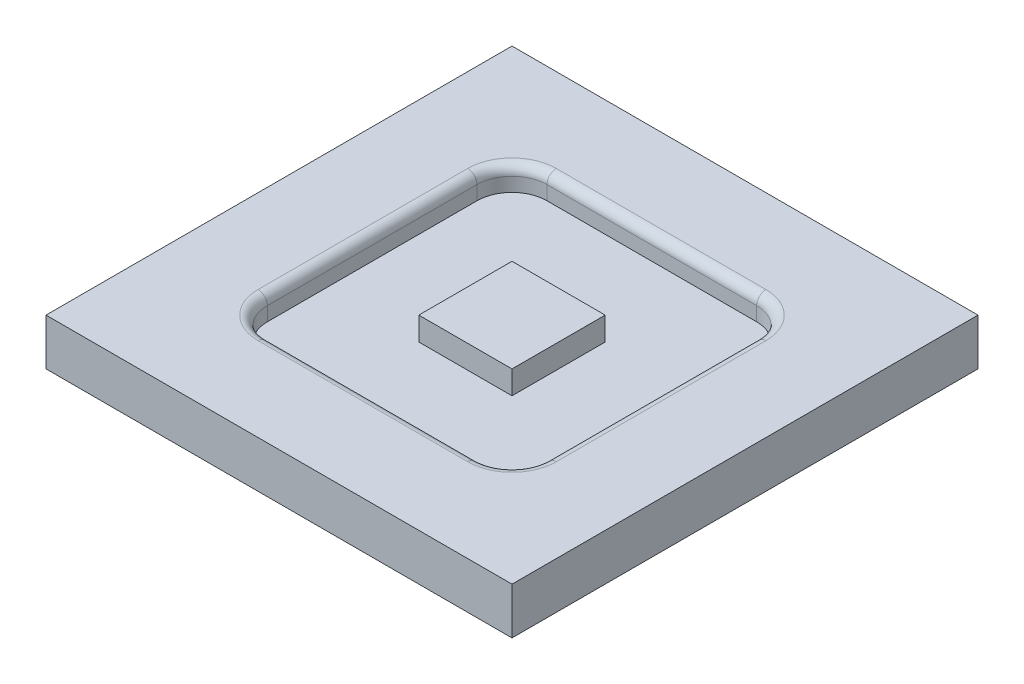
ISO-10303-21;
HEADER;
FILE_DESCRIPTION(('STEP AP214'),'2;1');
FILE_NAME('part.step','',(''),(''),'','','');
FILE_SCHEMA(('AUTOMOTIVE_DESIGN { 1 0 10303 214 1 1 1 1 }'));
ENDSEC;
DATA;
#1=APPLICATION_CONTEXT('core data for automotive mechanical design processes');
#2=APPLICATION_PROTOCOL_DEFINITION('international standard','automotive_design',2000,#1);
#3=PRODUCT_CONTEXT('',#1,'mechanical');
#4=PRODUCT('Part','Part','',(#3));
#5=PRODUCT_RELATED_PRODUCT_CATEGORY('part','',(#4));
#6=PRODUCT_DEFINITION_FORMATION('','',#4);
#7=PRODUCT_DEFINITION_CONTEXT('part definition',#1,'design');
#8=PRODUCT_DEFINITION('design','',#6,#7);
#9=PRODUCT_DEFINITION_SHAPE('','',#8);
#10=(LENGTH_UNIT() NAMED_UNIT(*) SI_UNIT(.MILLI.,.METRE.));
#11=(NAMED_UNIT(*) PLANE_ANGLE_UNIT() SI_UNIT($,.RADIAN.));
#12=(NAMED_UNIT(*) SI_UNIT($,.STERADIAN.) SOLID_ANGLE_UNIT());
#13=UNCERTAINTY_MEASURE_WITH_UNIT(LENGTH_MEASURE(1.E-05),#10,'distance_accuracy_value','');
#14=(GEOMETRIC_REPRESENTATION_CONTEXT(3) GLOBAL_UNCERTAINTY_ASSIGNED_CONTEXT((#13)) GLOBAL_UNIT_ASSIGNED_CONTEXT((#10,
#11,#12)) REPRESENTATION_CONTEXT('',''));
#15=CARTESIAN_POINT('',(0.,0.,0.));
#16=DIRECTION('',(0.,0.,1.));
#17=DIRECTION('',(1.,0.,0.));
#18=AXIS2_PLACEMENT_3D('',#15,#16,#17);
#19=CARTESIAN_POINT('',(38.1,6.35,38.1));
#20=DIRECTION('',(0.,-1.,0.));
#21=DIRECTION('',(0.,0.,-1.));
#22=AXIS2_PLACEMENT_3D('',#19,#20,#21);
#23=PLANE('',#22);
#24=DIRECTION('',(-1.,0.,0.));
#25=VECTOR('',#24,1.);
#26=CARTESIAN_POINT('',(38.1,6.35,-38.1));
#27=LINE('',#26,#25);
#28=CARTESIAN_POINT('',(28.575,6.35,-38.1));
#29=VERTEX_POINT('',#28);
#30=CARTESIAN_POINT('',(-28.575,6.35,-38.1));
#31=VERTEX_POINT('',#30);
#32=EDGE_CURVE('E197',#29,#31,#27,.T.);
#33=ORIENTED_EDGE('',*,*,#32,.T.);
#34=CARTESIAN_POINT('',(-28.575,6.35,-28.575));
#35=DIRECTION('',(0.,-1.,0.));
#36=DIRECTION('',(0.,0.,-1.));
#37=AXIS2_PLACEMENT_3D('',#34,#35,#36);
#38=CIRCLE('',#37,9.525);
#39=CARTESIAN_POINT('',(-38.1,6.35,-28.575));
#40=VERTEX_POINT('',#39);
#41=EDGE_CURVE('E266',#31,#40,#38,.F.);
#42=ORIENTED_EDGE('',*,*,#41,.T.);
#43=DIRECTION('',(0.,0.,1.));
#44=VECTOR('',#43,1.);
#45=CARTESIAN_POINT('',(-38.1,6.35,-38.1));
#46=LINE('',#45,#44);
#47=CARTESIAN_POINT('',(-38.1,6.35,28.575));
#48=VERTEX_POINT('',#47);
#49=EDGE_CURVE('E216',#40,#48,#46,.T.);
#50=ORIENTED_EDGE('',*,*,#49,.T.);
#51=CARTESIAN_POINT('',(-28.575,6.35,28.575));
#52=DIRECTION('',(0.,-1.,0.));
#53=DIRECTION('',(0.,0.,-1.));
#54=AXIS2_PLACEMENT_3D('',#51,#52,#53);
#55=CIRCLE('',#54,9.525);
#56=CARTESIAN_POINT('',(-28.575,6.35,38.1));
#57=VERTEX_POINT('',#56);
#58=EDGE_CURVE('E264',#48,#57,#55,.F.);
#59=ORIENTED_EDGE('',*,*,#58,.T.);
#60=DIRECTION('',(1.,0.,0.));
#61=VECTOR('',#60,1.);
#62=CARTESIAN_POINT('',(38.1,6.35,38.1));
#63=LINE('',#62,#61);
#64=CARTESIAN_POINT('',(28.575,6.35,38.1));
#65=VERTEX_POINT('',#64);
#66=EDGE_CURVE('E219',#57,#65,#63,.T.);
#67=ORIENTED_EDGE('',*,*,#66,.T.);
#68=CARTESIAN_POINT('',(28.575,6.35,28.575));
#69=DIRECTION('',(0.,-1.,0.));
#70=DIRECTION('',(0.,0.,-1.));
#71=AXIS2_PLACEMENT_3D('',#68,#69,#70);
#72=CIRCLE('',#71,9.525);
#73=CARTESIAN_POINT('',(38.1,6.35,28.575));
#74=VERTEX_POINT('',#73);
#75=EDGE_CURVE('E262',#65,#74,#72,.F.);
#76=ORIENTED_EDGE('',*,*,#75,.T.);
#77=DIRECTION('',(0.,0.,-1.));
#78=VECTOR('',#77,1.);
#79=CARTESIAN_POINT('',(38.1,6.35,-38.1));
#80=LINE('',#79,#78);
#81=CARTESIAN_POINT('',(38.1,6.35,-28.575));
#82=VERTEX_POINT('',#81);
#83=EDGE_CURVE('E194',#74,#82,#80,.T.);
#84=ORIENTED_EDGE('',*,*,#83,.T.);
#85=CARTESIAN_POINT('',(28.575,6.35,-28.575));
#86=DIRECTION('',(0.,-1.,0.));
#87=DIRECTION('',(0.,0.,-1.));
#88=AXIS2_PLACEMENT_3D('',#85,#86,#87);
#89=CIRCLE('',#88,9.525);
#90=EDGE_CURVE('E260',#82,#29,#89,.F.);
#91=ORIENTED_EDGE('',*,*,#90,.T.);
#92=EDGE_LOOP('',(#33,#42,#50,#59,#67,#76,#84,#91));
#93=FACE_BOUND('',#92,.T.);
#94=DIRECTION('',(0.,0.,-1.));
#95=VECTOR('',#94,1.);
#96=CARTESIAN_POINT('',(12.7,6.35,-12.7));
#97=LINE('',#96,#95);
#98=CARTESIAN_POINT('',(12.7,6.35,12.7));
#99=VERTEX_POINT('',#98);
#100=CARTESIAN_POINT('',(12.7,6.35,-12.7));
#101=VERTEX_POINT('',#100);
#102=EDGE_CURVE('E201',#99,#101,#97,.T.);
#103=ORIENTED_EDGE('',*,*,#102,.F.);
#104=DIRECTION('',(1.,0.,0.));
#105=VECTOR('',#104,1.);
#106=CARTESIAN_POINT('',(12.7,6.35,12.7));
#107=LINE('',#106,#105);
#108=CARTESIAN_POINT('',(-12.7,6.35,12.7));
#109=VERTEX_POINT('',#108);
#110=EDGE_CURVE('E179',#109,#99,#107,.T.);
#111=ORIENTED_EDGE('',*,*,#110,.F.);
#112=DIRECTION('',(0.,0.,1.));
#113=VECTOR('',#112,1.);
#114=CARTESIAN_POINT('',(-12.7,6.35,-12.7));
#115=LINE('',#114,#113);
#116=CARTESIAN_POINT('',(-12.7,6.35,-12.7));
#117=VERTEX_POINT('',#116);
#118=EDGE_CURVE('E176',#117,#109,#115,.T.);
#119=ORIENTED_EDGE('',*,*,#118,.F.);
#120=DIRECTION('',(-1.,0.,0.));
#121=VECTOR('',#120,1.);
#122=CARTESIAN_POINT('',(12.7,6.35,-12.7));
#123=LINE('',#122,#121);
#124=EDGE_CURVE('E208',#101,#117,#123,.T.);
#125=ORIENTED_EDGE('',*,*,#124,.F.);
#126=EDGE_LOOP('',(#103,#111,#119,#125));
#127=FACE_BOUND('',#126,.T.);
#128=ADVANCED_FACE('F33',(#93,#127),#23,.F.);
#129=CARTESIAN_POINT('',(-63.5,12.7,-63.5));
#130=DIRECTION('',(1.,0.,0.));
#131=DIRECTION('',(0.,0.,-1.));
#132=AXIS2_PLACEMENT_3D('',#129,#130,#131);
#133=PLANE('',#132);
#134=DIRECTION('',(0.,0.,1.));
#135=VECTOR('',#134,1.);
#136=CARTESIAN_POINT('',(-63.5,0.,-63.5));
#137=LINE('',#136,#135);
#138=CARTESIAN_POINT('',(-63.5,0.,-63.5));
#139=VERTEX_POINT('',#138);
#140=CARTESIAN_POINT('',(-63.5,0.,63.5));
#141=VERTEX_POINT('',#140);
#142=EDGE_CURVE('E222',#139,#141,#137,.T.);
#143=ORIENTED_EDGE('',*,*,#142,.T.);
#144=DIRECTION('',(0.,-1.,0.));
#145=VECTOR('',#144,1.);
#146=CARTESIAN_POINT('',(-63.5,12.7,63.5));
#147=LINE('',#146,#145);
#148=CARTESIAN_POINT('',(-63.5,12.7,63.5));
#149=VERTEX_POINT('',#148);
#150=EDGE_CURVE('E249',#149,#141,#147,.T.);
#151=ORIENTED_EDGE('',*,*,#150,.F.);
#152=DIRECTION('',(0.,0.,1.));
#153=VECTOR('',#152,1.);
#154=CARTESIAN_POINT('',(-63.5,12.7,-63.5));
#155=LINE('',#154,#153);
#156=CARTESIAN_POINT('',(-63.5,12.7,-63.5));
#157=VERTEX_POINT('',#156);
#158=EDGE_CURVE('E231',#157,#149,#155,.T.);
#159=ORIENTED_EDGE('',*,*,#158,.F.);
#160=DIRECTION('',(0.,-1.,0.));
#161=VECTOR('',#160,1.);
#162=CARTESIAN_POINT('',(-63.5,12.7,-63.5));
#163=LINE('',#162,#161);
#164=EDGE_CURVE('E240',#157,#139,#163,.T.);
#165=ORIENTED_EDGE('',*,*,#164,.T.);
#166=EDGE_LOOP('',(#143,#151,#159,#165));
#167=FACE_BOUND('',#166,.T.);
#168=ADVANCED_FACE('F35',(#167),#133,.F.);
#169=CARTESIAN_POINT('',(-63.5,12.7,63.5));
#170=DIRECTION('',(0.,0.,-1.));
#171=DIRECTION('',(-1.,0.,0.));
#172=AXIS2_PLACEMENT_3D('',#169,#170,#171);
#173=PLANE('',#172);
#174=DIRECTION('',(1.,0.,0.));
#175=VECTOR('',#174,1.);
#176=CARTESIAN_POINT('',(-63.5,0.,63.5));
#177=LINE('',#176,#175);
#178=CARTESIAN_POINT('',(63.5,0.,63.5));
#179=VERTEX_POINT('',#178);
#180=EDGE_CURVE('E225',#141,#179,#177,.T.);
#181=ORIENTED_EDGE('',*,*,#180,.T.);
#182=DIRECTION('',(0.,-1.,0.));
#183=VECTOR('',#182,1.);
#184=CARTESIAN_POINT('',(63.5,12.7,63.5));
#185=LINE('',#184,#183);
#186=CARTESIAN_POINT('',(63.5,12.7,63.5));
#187=VERTEX_POINT('',#186);
#188=EDGE_CURVE('E246',#187,#179,#185,.T.);
#189=ORIENTED_EDGE('',*,*,#188,.F.);
#190=DIRECTION('',(1.,0.,0.));
#191=VECTOR('',#190,1.);
#192=CARTESIAN_POINT('',(-63.5,12.7,63.5));
#193=LINE('',#192,#191);
#194=EDGE_CURVE('E234',#149,#187,#193,.T.);
#195=ORIENTED_EDGE('',*,*,#194,.F.);
#196=ORIENTED_EDGE('',*,*,#150,.T.);
#197=EDGE_LOOP('',(#181,#189,#195,#196));
#198=FACE_BOUND('',#197,.T.);
#199=ADVANCED_FACE('F365',(#198),#173,.F.);
#200=CARTESIAN_POINT('',(63.5,12.7,-63.5));
#201=DIRECTION('',(-1.,0.,0.));
#202=DIRECTION('',(0.,0.,1.));
#203=AXIS2_PLACEMENT_3D('',#200,#201,#202);
#204=PLANE('',#203);
#205=DIRECTION('',(0.,0.,-1.));
#206=VECTOR('',#205,1.);
#207=CARTESIAN_POINT('',(63.5,0.,-63.5));
#208=LINE('',#207,#206);
#209=CARTESIAN_POINT('',(63.5,0.,-63.5));
#210=VERTEX_POINT('',#209);
#211=EDGE_CURVE('E227',#179,#210,#208,.T.);
#212=ORIENTED_EDGE('',*,*,#211,.T.);
#213=DIRECTION('',(0.,-1.,0.));
#214=VECTOR('',#213,1.);
#215=CARTESIAN_POINT('',(63.5,12.7,-63.5));
#216=LINE('',#215,#214);
#217=CARTESIAN_POINT('',(63.5,12.7,-63.5));
#218=VERTEX_POINT('',#217);
#219=EDGE_CURVE('E243',#218,#210,#216,.T.);
#220=ORIENTED_EDGE('',*,*,#219,.F.);
#221=DIRECTION('',(0.,0.,-1.));
#222=VECTOR('',#221,1.);
#223=CARTESIAN_POINT('',(63.5,12.7,-63.5));
#224=LINE('',#223,#222);
#225=EDGE_CURVE('E236',#187,#218,#224,.T.);
#226=ORIENTED_EDGE('',*,*,#225,.F.);
#227=ORIENTED_EDGE('',*,*,#188,.T.);
#228=EDGE_LOOP('',(#212,#220,#226,#227));
#229=FACE_BOUND('',#228,.T.);
#230=ADVANCED_FACE('F395',(#229),#204,.F.);
#231=CARTESIAN_POINT('',(-63.5,12.7,-63.5));
#232=DIRECTION('',(0.,0.,1.));
#233=DIRECTION('',(1.,0.,0.));
#234=AXIS2_PLACEMENT_3D('',#231,#232,#233);
#235=PLANE('',#234);
#236=DIRECTION('',(-1.,0.,0.));
#237=VECTOR('',#236,1.);
#238=CARTESIAN_POINT('',(-63.5,0.,-63.5));
#239=LINE('',#238,#237);
#240=EDGE_CURVE('E229',#210,#139,#239,.T.);
#241=ORIENTED_EDGE('',*,*,#240,.T.);
#242=ORIENTED_EDGE('',*,*,#164,.F.);
#243=DIRECTION('',(-1.,0.,0.));
#244=VECTOR('',#243,1.);
#245=CARTESIAN_POINT('',(-63.5,12.7,-63.5));
#246=LINE('',#245,#244);
#247=EDGE_CURVE('E238',#218,#157,#246,.T.);
#248=ORIENTED_EDGE('',*,*,#247,.F.);
#249=ORIENTED_EDGE('',*,*,#219,.T.);
#250=EDGE_LOOP('',(#241,#242,#248,#249));
#251=FACE_BOUND('',#250,.T.);
#252=ADVANCED_FACE('F391',(#251),#235,.F.);
#253=CARTESIAN_POINT('',(-63.5,12.7,63.5));
#254=DIRECTION('',(0.,1.,0.));
#255=DIRECTION('',(0.,0.,1.));
#256=AXIS2_PLACEMENT_3D('',#253,#254,#255);
#257=PLANE('',#256);
#258=DIRECTION('',(-1.,0.,0.));
#259=VECTOR('',#258,1.);
#260=CARTESIAN_POINT('',(28.575,12.7,-40.64));
#261=LINE('',#260,#259);
#262=CARTESIAN_POINT('',(-28.575,12.7,-40.64));
#263=VERTEX_POINT('',#262);
#264=CARTESIAN_POINT('',(28.575,12.7,-40.64));
#265=VERTEX_POINT('',#264);
#266=EDGE_CURVE('E278',#263,#265,#261,.F.);
#267=ORIENTED_EDGE('',*,*,#266,.T.);
#268=CARTESIAN_POINT('',(28.575,12.7,-28.575));
#269=DIRECTION('',(0.,1.,0.));
#270=DIRECTION('',(0.,0.,1.));
#271=AXIS2_PLACEMENT_3D('',#268,#269,#270);
#272=CIRCLE('',#271,12.065);
#273=CARTESIAN_POINT('',(40.64,12.7,-28.575));
#274=VERTEX_POINT('',#273);
#275=EDGE_CURVE('E292',#265,#274,#272,.F.);
#276=ORIENTED_EDGE('',*,*,#275,.T.);
#277=DIRECTION('',(0.,0.,-1.));
#278=VECTOR('',#277,1.);
#279=CARTESIAN_POINT('',(40.64,12.7,28.575));
#280=LINE('',#279,#278);
#281=CARTESIAN_POINT('',(40.64,12.7,28.575));
#282=VERTEX_POINT('',#281);
#283=EDGE_CURVE('E290',#274,#282,#280,.F.);
#284=ORIENTED_EDGE('',*,*,#283,.T.);
#285=CARTESIAN_POINT('',(28.575,12.7,28.575));
#286=DIRECTION('',(0.,1.,0.));
#287=DIRECTION('',(0.,0.,1.));
#288=AXIS2_PLACEMENT_3D('',#285,#286,#287);
#289=CIRCLE('',#288,12.065);
#290=CARTESIAN_POINT('',(28.575,12.7,40.64));
#291=VERTEX_POINT('',#290);
#292=EDGE_CURVE('E288',#282,#291,#289,.F.);
#293=ORIENTED_EDGE('',*,*,#292,.T.);
#294=DIRECTION('',(1.,0.,0.));
#295=VECTOR('',#294,1.);
#296=CARTESIAN_POINT('',(-28.575,12.7,40.64));
#297=LINE('',#296,#295);
#298=CARTESIAN_POINT('',(-28.575,12.7,40.64));
#299=VERTEX_POINT('',#298);
#300=EDGE_CURVE('E286',#291,#299,#297,.F.);
#301=ORIENTED_EDGE('',*,*,#300,.T.);
#302=CARTESIAN_POINT('',(-28.575,12.7,28.575));
#303=DIRECTION('',(0.,1.,0.));
#304=DIRECTION('',(0.,0.,1.));
#305=AXIS2_PLACEMENT_3D('',#302,#303,#304);
#306=CIRCLE('',#305,12.065);
#307=CARTESIAN_POINT('',(-40.64,12.7,28.575));
#308=VERTEX_POINT('',#307);
#309=EDGE_CURVE('E284',#299,#308,#306,.F.);
#310=ORIENTED_EDGE('',*,*,#309,.T.);
#311=DIRECTION('',(0.,0.,1.));
#312=VECTOR('',#311,1.);
#313=CARTESIAN_POINT('',(-40.64,12.7,-28.575));
#314=LINE('',#313,#312);
#315=CARTESIAN_POINT('',(-40.64,12.7,-28.575));
#316=VERTEX_POINT('',#315);
#317=EDGE_CURVE('E282',#308,#316,#314,.F.);
#318=ORIENTED_EDGE('',*,*,#317,.T.);
#319=CARTESIAN_POINT('',(-28.575,12.7,-28.575));
#320=DIRECTION('',(0.,1.,0.));
#321=DIRECTION('',(0.,0.,1.));
#322=AXIS2_PLACEMENT_3D('',#319,#320,#321);
#323=CIRCLE('',#322,12.065);
#324=EDGE_CURVE('E280',#316,#263,#323,.F.);
#325=ORIENTED_EDGE('',*,*,#324,.T.);
#326=EDGE_LOOP('',(#267,#276,#284,#293,#301,#310,#318,#325));
#327=FACE_BOUND('',#326,.T.);
#328=ORIENTED_EDGE('',*,*,#158,.T.);
#329=ORIENTED_EDGE('',*,*,#194,.T.);
#330=ORIENTED_EDGE('',*,*,#225,.T.);
#331=ORIENTED_EDGE('',*,*,#247,.T.);
#332=EDGE_LOOP('',(#328,#329,#330,#331));
#333=FACE_BOUND('',#332,.T.);
#334=ADVANCED_FACE('F387',(#327,#333),#257,.T.);
#335=CARTESIAN_POINT('',(-63.5,0.,63.5));
#336=DIRECTION('',(0.,1.,0.));
#337=DIRECTION('',(0.,0.,1.));
#338=AXIS2_PLACEMENT_3D('',#335,#336,#337);
#339=PLANE('',#338);
#340=ORIENTED_EDGE('',*,*,#142,.F.);
#341=ORIENTED_EDGE('',*,*,#240,.F.);
#342=ORIENTED_EDGE('',*,*,#211,.F.);
#343=ORIENTED_EDGE('',*,*,#180,.F.);
#344=EDGE_LOOP('',(#340,#341,#342,#343));
#345=FACE_BOUND('',#344,.T.);
#346=ADVANCED_FACE('F383',(#345),#339,.F.);
#347=CARTESIAN_POINT('',(38.1,6.35,-38.1));
#348=DIRECTION('',(1.,0.,0.));
#349=DIRECTION('',(0.,0.,-1.));
#350=AXIS2_PLACEMENT_3D('',#347,#348,#349);
#351=PLANE('',#350);
#352=DIRECTION('',(0.,1.,0.));
#353=VECTOR('',#352,1.);
#354=CARTESIAN_POINT('',(38.1,12.7,28.575));
#355=LINE('',#354,#353);
#356=CARTESIAN_POINT('',(38.1,10.16,28.575));
#357=VERTEX_POINT('',#356);
#358=EDGE_CURVE('E275',#74,#357,#355,.T.);
#359=ORIENTED_EDGE('',*,*,#358,.T.);
#360=DIRECTION('',(0.,0.,-1.));
#361=VECTOR('',#360,1.);
#362=CARTESIAN_POINT('',(38.1,10.16,-28.575));
#363=LINE('',#362,#361);
#364=CARTESIAN_POINT('',(38.1,10.16,-28.575));
#365=VERTEX_POINT('',#364);
#366=EDGE_CURVE('E298',#357,#365,#363,.T.);
#367=ORIENTED_EDGE('',*,*,#366,.T.);
#368=DIRECTION('',(0.,1.,0.));
#369=VECTOR('',#368,1.);
#370=CARTESIAN_POINT('',(38.1,6.35,-28.575));
#371=LINE('',#370,#369);
#372=EDGE_CURVE('E273',#365,#82,#371,.F.);
#373=ORIENTED_EDGE('',*,*,#372,.T.);
#374=ORIENTED_EDGE('',*,*,#83,.F.);
#375=EDGE_LOOP('',(#359,#367,#373,#374));
#376=FACE_BOUND('',#375,.T.);
#377=ADVANCED_FACE('F374',(#376),#351,.F.);
#378=CARTESIAN_POINT('',(38.1,6.35,38.1));
#379=DIRECTION('',(0.,0.,1.));
#380=DIRECTION('',(1.,0.,0.));
#381=AXIS2_PLACEMENT_3D('',#378,#379,#380);
#382=PLANE('',#381);
#383=DIRECTION('',(0.,1.,0.));
#384=VECTOR('',#383,1.);
#385=CARTESIAN_POINT('',(-28.575,12.7,38.1));
#386=LINE('',#385,#384);
#387=CARTESIAN_POINT('',(-28.575,10.16,38.1));
#388=VERTEX_POINT('',#387);
#389=EDGE_CURVE('E270',#57,#388,#386,.T.);
#390=ORIENTED_EDGE('',*,*,#389,.T.);
#391=DIRECTION('',(1.,0.,0.));
#392=VECTOR('',#391,1.);
#393=CARTESIAN_POINT('',(28.575,10.16,38.1));
#394=LINE('',#393,#392);
#395=CARTESIAN_POINT('',(28.575,10.16,38.1));
#396=VERTEX_POINT('',#395);
#397=EDGE_CURVE('E302',#388,#396,#394,.T.);
#398=ORIENTED_EDGE('',*,*,#397,.T.);
#399=DIRECTION('',(0.,1.,0.));
#400=VECTOR('',#399,1.);
#401=CARTESIAN_POINT('',(28.575,6.35,38.1));
#402=LINE('',#401,#400);
#403=EDGE_CURVE('E268',#396,#65,#402,.F.);
#404=ORIENTED_EDGE('',*,*,#403,.T.);
#405=ORIENTED_EDGE('',*,*,#66,.F.);
#406=EDGE_LOOP('',(#390,#398,#404,#405));
#407=FACE_BOUND('',#406,.T.);
#408=ADVANCED_FACE('F371',(#407),#382,.F.);
#409=CARTESIAN_POINT('',(-38.1,6.35,-38.1));
#410=DIRECTION('',(-1.,0.,0.));
#411=DIRECTION('',(0.,0.,1.));
#412=AXIS2_PLACEMENT_3D('',#409,#410,#411);
#413=PLANE('',#412);
#414=DIRECTION('',(0.,1.,0.));
#415=VECTOR('',#414,1.);
#416=CARTESIAN_POINT('',(-38.1,12.7,-28.575));
#417=LINE('',#416,#415);
#418=CARTESIAN_POINT('',(-38.1,10.16,-28.575));
#419=VERTEX_POINT('',#418);
#420=EDGE_CURVE('E254',#40,#419,#417,.T.);
#421=ORIENTED_EDGE('',*,*,#420,.T.);
#422=DIRECTION('',(0.,0.,1.));
#423=VECTOR('',#422,1.);
#424=CARTESIAN_POINT('',(-38.1,10.16,28.575));
#425=LINE('',#424,#423);
#426=CARTESIAN_POINT('',(-38.1,10.16,28.575));
#427=VERTEX_POINT('',#426);
#428=EDGE_CURVE('E306',#419,#427,#425,.T.);
#429=ORIENTED_EDGE('',*,*,#428,.T.);
#430=DIRECTION('',(0.,1.,0.));
#431=VECTOR('',#430,1.);
#432=CARTESIAN_POINT('',(-38.1,6.35,28.575));
#433=LINE('',#432,#431);
#434=EDGE_CURVE('E252',#427,#48,#433,.F.);
#435=ORIENTED_EDGE('',*,*,#434,.T.);
#436=ORIENTED_EDGE('',*,*,#49,.F.);
#437=EDGE_LOOP('',(#421,#429,#435,#436));
#438=FACE_BOUND('',#437,.T.);
#439=ADVANCED_FACE('F310',(#438),#413,.F.);
#440=CARTESIAN_POINT('',(38.1,6.35,-38.1));
#441=DIRECTION('',(0.,0.,-1.));
#442=DIRECTION('',(-1.,0.,0.));
#443=AXIS2_PLACEMENT_3D('',#440,#441,#442);
#444=PLANE('',#443);
#445=DIRECTION('',(0.,1.,0.));
#446=VECTOR('',#445,1.);
#447=CARTESIAN_POINT('',(28.575,12.7,-38.1));
#448=LINE('',#447,#446);
#449=CARTESIAN_POINT('',(28.575,10.16,-38.1));
#450=VERTEX_POINT('',#449);
#451=EDGE_CURVE('E256',#29,#450,#448,.T.);
#452=ORIENTED_EDGE('',*,*,#451,.T.);
#453=DIRECTION('',(-1.,0.,0.));
#454=VECTOR('',#453,1.);
#455=CARTESIAN_POINT('',(-28.575,10.16,-38.1));
#456=LINE('',#455,#454);
#457=CARTESIAN_POINT('',(-28.575,10.16,-38.1));
#458=VERTEX_POINT('',#457);
#459=EDGE_CURVE('E11',#450,#458,#456,.T.);
#460=ORIENTED_EDGE('',*,*,#459,.T.);
#461=DIRECTION('',(0.,1.,0.));
#462=VECTOR('',#461,1.);
#463=CARTESIAN_POINT('',(-28.575,6.35,-38.1));
#464=LINE('',#463,#462);
#465=EDGE_CURVE('E258',#458,#31,#464,.F.);
#466=ORIENTED_EDGE('',*,*,#465,.T.);
#467=ORIENTED_EDGE('',*,*,#32,.F.);
#468=EDGE_LOOP('',(#452,#460,#466,#467));
#469=FACE_BOUND('',#468,.T.);
#470=ADVANCED_FACE('F378',(#469),#444,.F.);
#471=CARTESIAN_POINT('',(-28.575,6.35,-28.575));
#472=DIRECTION('',(0.,-1.,0.));
#473=DIRECTION('',(0.,0.,-1.));
#474=AXIS2_PLACEMENT_3D('',#471,#472,#473);
#475=CYLINDRICAL_SURFACE('',#474,9.525);
#476=ORIENTED_EDGE('',*,*,#465,.F.);
#477=CARTESIAN_POINT('',(-28.575,10.16,-28.575));
#478=DIRECTION('',(0.,1.,0.));
#479=DIRECTION('',(0.,0.,1.));
#480=AXIS2_PLACEMENT_3D('',#477,#478,#479);
#481=CIRCLE('',#480,9.525);
#482=EDGE_CURVE('E41',#458,#419,#481,.T.);
#483=ORIENTED_EDGE('',*,*,#482,.T.);
#484=ORIENTED_EDGE('',*,*,#420,.F.);
#485=ORIENTED_EDGE('',*,*,#41,.F.);
#486=EDGE_LOOP('',(#476,#483,#484,#485));
#487=FACE_BOUND('',#486,.T.);
#488=ADVANCED_FACE('F369',(#487),#475,.F.);
#489=CARTESIAN_POINT('',(-28.575,6.35,28.575));
#490=DIRECTION('',(0.,-1.,0.));
#491=DIRECTION('',(0.,0.,-1.));
#492=AXIS2_PLACEMENT_3D('',#489,#490,#491);
#493=CYLINDRICAL_SURFACE('',#492,9.525);
#494=ORIENTED_EDGE('',*,*,#434,.F.);
#495=CARTESIAN_POINT('',(-28.575,10.16,28.575));
#496=DIRECTION('',(0.,1.,0.));
#497=DIRECTION('',(0.,0.,1.));
#498=AXIS2_PLACEMENT_3D('',#495,#496,#497);
#499=CIRCLE('',#498,9.525);
#500=EDGE_CURVE('E304',#427,#388,#499,.T.);
#501=ORIENTED_EDGE('',*,*,#500,.T.);
#502=ORIENTED_EDGE('',*,*,#389,.F.);
#503=ORIENTED_EDGE('',*,*,#58,.F.);
#504=EDGE_LOOP('',(#494,#501,#502,#503));
#505=FACE_BOUND('',#504,.T.);
#506=ADVANCED_FACE('F319',(#505),#493,.F.);
#507=CARTESIAN_POINT('',(28.575,6.35,28.575));
#508=DIRECTION('',(0.,-1.,0.));
#509=DIRECTION('',(0.,0.,-1.));
#510=AXIS2_PLACEMENT_3D('',#507,#508,#509);
#511=CYLINDRICAL_SURFACE('',#510,9.525);
#512=ORIENTED_EDGE('',*,*,#403,.F.);
#513=CARTESIAN_POINT('',(28.575,10.16,28.575));
#514=DIRECTION('',(0.,1.,0.));
#515=DIRECTION('',(0.,0.,1.));
#516=AXIS2_PLACEMENT_3D('',#513,#514,#515);
#517=CIRCLE('',#516,9.525);
#518=EDGE_CURVE('E300',#396,#357,#517,.T.);
#519=ORIENTED_EDGE('',*,*,#518,.T.);
#520=ORIENTED_EDGE('',*,*,#358,.F.);
#521=ORIENTED_EDGE('',*,*,#75,.F.);
#522=EDGE_LOOP('',(#512,#519,#520,#521));
#523=FACE_BOUND('',#522,.T.);
#524=ADVANCED_FACE('F355',(#523),#511,.F.);
#525=CARTESIAN_POINT('',(28.575,6.35,-28.575));
#526=DIRECTION('',(0.,-1.,0.));
#527=DIRECTION('',(0.,0.,-1.));
#528=AXIS2_PLACEMENT_3D('',#525,#526,#527);
#529=CYLINDRICAL_SURFACE('',#528,9.525);
#530=ORIENTED_EDGE('',*,*,#372,.F.);
#531=CARTESIAN_POINT('',(28.575,10.16,-28.575));
#532=DIRECTION('',(0.,1.,0.));
#533=DIRECTION('',(0.,0.,1.));
#534=AXIS2_PLACEMENT_3D('',#531,#532,#533);
#535=CIRCLE('',#534,9.525);
#536=EDGE_CURVE('E295',#365,#450,#535,.T.);
#537=ORIENTED_EDGE('',*,*,#536,.T.);
#538=ORIENTED_EDGE('',*,*,#451,.F.);
#539=ORIENTED_EDGE('',*,*,#90,.F.);
#540=EDGE_LOOP('',(#530,#537,#538,#539));
#541=FACE_BOUND('',#540,.T.);
#542=ADVANCED_FACE('F347',(#541),#529,.F.);
#543=CARTESIAN_POINT('',(12.7,48.6210244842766,-12.7));
#544=DIRECTION('',(-1.,0.,0.));
#545=DIRECTION('',(0.,0.,1.));
#546=AXIS2_PLACEMENT_3D('',#543,#544,#545);
#547=PLANE('',#546);
#548=DIRECTION('',(0.,0.,-1.));
#549=VECTOR('',#548,1.);
#550=CARTESIAN_POINT('',(12.7,12.7,-12.7));
#551=LINE('',#550,#549);
#552=CARTESIAN_POINT('',(12.7,12.7,12.7));
#553=VERTEX_POINT('',#552);
#554=CARTESIAN_POINT('',(12.7,12.7,-12.7));
#555=VERTEX_POINT('',#554);
#556=EDGE_CURVE('E189',#553,#555,#551,.T.);
#557=ORIENTED_EDGE('',*,*,#556,.F.);
#558=DIRECTION('',(0.,-1.,0.));
#559=VECTOR('',#558,1.);
#560=CARTESIAN_POINT('',(12.7,48.6210244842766,12.7));
#561=LINE('',#560,#559);
#562=EDGE_CURVE('E185',#553,#99,#561,.T.);
#563=ORIENTED_EDGE('',*,*,#562,.T.);
#564=ORIENTED_EDGE('',*,*,#102,.T.);
#565=DIRECTION('',(0.,-1.,0.));
#566=VECTOR('',#565,1.);
#567=CARTESIAN_POINT('',(12.7,48.6210244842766,-12.7));
#568=LINE('',#567,#566);
#569=EDGE_CURVE('E205',#555,#101,#568,.T.);
#570=ORIENTED_EDGE('',*,*,#569,.F.);
#571=EDGE_LOOP('',(#557,#563,#564,#570));
#572=FACE_BOUND('',#571,.T.);
#573=ADVANCED_FACE('F345',(#572),#547,.F.);
#574=CARTESIAN_POINT('',(12.7,48.6210244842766,-12.7));
#575=DIRECTION('',(0.,0.,1.));
#576=DIRECTION('',(1.,0.,0.));
#577=AXIS2_PLACEMENT_3D('',#574,#575,#576);
#578=PLANE('',#577);
#579=DIRECTION('',(-1.,0.,0.));
#580=VECTOR('',#579,1.);
#581=CARTESIAN_POINT('',(12.7,12.7,-12.7));
#582=LINE('',#581,#580);
#583=CARTESIAN_POINT('',(-12.7,12.7,-12.7));
#584=VERTEX_POINT('',#583);
#585=EDGE_CURVE('E193',#555,#584,#582,.T.);
#586=ORIENTED_EDGE('',*,*,#585,.F.);
#587=ORIENTED_EDGE('',*,*,#569,.T.);
#588=ORIENTED_EDGE('',*,*,#124,.T.);
#589=DIRECTION('',(0.,-1.,0.));
#590=VECTOR('',#589,1.);
#591=CARTESIAN_POINT('',(-12.7,48.6210244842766,-12.7));
#592=LINE('',#591,#590);
#593=EDGE_CURVE('E209',#584,#117,#592,.T.);
#594=ORIENTED_EDGE('',*,*,#593,.F.);
#595=EDGE_LOOP('',(#586,#587,#588,#594));
#596=FACE_BOUND('',#595,.T.);
#597=ADVANCED_FACE('F340',(#596),#578,.F.);
#598=CARTESIAN_POINT('',(-12.7,48.6210244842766,-12.7));
#599=DIRECTION('',(1.,0.,0.));
#600=DIRECTION('',(0.,0.,-1.));
#601=AXIS2_PLACEMENT_3D('',#598,#599,#600);
#602=PLANE('',#601);
#603=DIRECTION('',(0.,0.,1.));
#604=VECTOR('',#603,1.);
#605=CARTESIAN_POINT('',(-12.7,12.7,-12.7));
#606=LINE('',#605,#604);
#607=CARTESIAN_POINT('',(-12.7,12.7,12.7));
#608=VERTEX_POINT('',#607);
#609=EDGE_CURVE('E174',#584,#608,#606,.T.);
#610=ORIENTED_EDGE('',*,*,#609,.F.);
#611=ORIENTED_EDGE('',*,*,#593,.T.);
#612=ORIENTED_EDGE('',*,*,#118,.T.);
#613=DIRECTION('',(0.,-1.,0.));
#614=VECTOR('',#613,1.);
#615=CARTESIAN_POINT('',(-12.7,48.6210244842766,12.7));
#616=LINE('',#615,#614);
#617=EDGE_CURVE('E169',#608,#109,#616,.T.);
#618=ORIENTED_EDGE('',*,*,#617,.F.);
#619=EDGE_LOOP('',(#610,#611,#612,#618));
#620=FACE_BOUND('',#619,.T.);
#621=ADVANCED_FACE('F171',(#620),#602,.F.);
#622=CARTESIAN_POINT('',(12.7,48.6210244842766,12.7));
#623=DIRECTION('',(0.,0.,-1.));
#624=DIRECTION('',(-1.,0.,0.));
#625=AXIS2_PLACEMENT_3D('',#622,#623,#624);
#626=PLANE('',#625);
#627=DIRECTION('',(1.,0.,0.));
#628=VECTOR('',#627,1.);
#629=CARTESIAN_POINT('',(12.7,12.7,12.7));
#630=LINE('',#629,#628);
#631=EDGE_CURVE('E182',#608,#553,#630,.T.);
#632=ORIENTED_EDGE('',*,*,#631,.F.);
#633=ORIENTED_EDGE('',*,*,#617,.T.);
#634=ORIENTED_EDGE('',*,*,#110,.T.);
#635=ORIENTED_EDGE('',*,*,#562,.F.);
#636=EDGE_LOOP('',(#632,#633,#634,#635));
#637=FACE_BOUND('',#636,.T.);
#638=ADVANCED_FACE('F183',(#637),#626,.F.);
#639=CARTESIAN_POINT('',(-63.5,12.7,63.5));
#640=DIRECTION('',(0.,1.,0.));
#641=DIRECTION('',(0.,0.,1.));
#642=AXIS2_PLACEMENT_3D('',#639,#640,#641);
#643=PLANE('',#642);
#644=ORIENTED_EDGE('',*,*,#631,.T.);
#645=ORIENTED_EDGE('',*,*,#556,.T.);
#646=ORIENTED_EDGE('',*,*,#585,.T.);
#647=ORIENTED_EDGE('',*,*,#609,.T.);
#648=EDGE_LOOP('',(#644,#645,#646,#647));
#649=FACE_BOUND('',#648,.T.);
#650=ADVANCED_FACE('F192',(#649),#643,.T.);
#651=CARTESIAN_POINT('',(-28.575,10.16,28.575));
#652=DIRECTION('',(0.,1.,0.));
#653=DIRECTION('',(0.,0.,1.));
#654=AXIS2_PLACEMENT_3D('',#651,#652,#653);
#655=TOROIDAL_SURFACE('',#654,12.065,2.54);
#656=CARTESIAN_POINT('',(-28.575,10.16,40.64));
#657=DIRECTION('',(1.,0.,0.));
#658=DIRECTION('',(0.,0.,-1.));
#659=AXIS2_PLACEMENT_3D('',#656,#657,#658);
#660=CIRCLE('',#659,2.54);
#661=EDGE_CURVE('E328',#388,#299,#660,.T.);
#662=ORIENTED_EDGE('',*,*,#661,.F.);
#663=ORIENTED_EDGE('',*,*,#500,.F.);
#664=CARTESIAN_POINT('',(-40.64,10.16,28.575));
#665=DIRECTION('',(0.,0.,-1.));
#666=DIRECTION('',(-1.,0.,0.));
#667=AXIS2_PLACEMENT_3D('',#664,#665,#666);
#668=CIRCLE('',#667,2.54);
#669=EDGE_CURVE('E211',#308,#427,#668,.T.);
#670=ORIENTED_EDGE('',*,*,#669,.F.);
#671=ORIENTED_EDGE('',*,*,#309,.F.);
#672=EDGE_LOOP('',(#662,#663,#670,#671));
#673=FACE_BOUND('',#672,.T.);
#674=ADVANCED_FACE('F324',(#673),#655,.T.);
#675=CARTESIAN_POINT('',(-40.64,10.16,-38.1));
#676=DIRECTION('',(0.,0.,-1.));
#677=DIRECTION('',(-1.,0.,0.));
#678=AXIS2_PLACEMENT_3D('',#675,#676,#677);
#679=CYLINDRICAL_SURFACE('',#678,2.54);
#680=ORIENTED_EDGE('',*,*,#669,.T.);
#681=ORIENTED_EDGE('',*,*,#428,.F.);
#682=CARTESIAN_POINT('',(-40.64,10.16,-28.575));
#683=DIRECTION('',(0.,0.,-1.));
#684=DIRECTION('',(-1.,0.,0.));
#685=AXIS2_PLACEMENT_3D('',#682,#683,#684);
#686=CIRCLE('',#685,2.54);
#687=EDGE_CURVE('E332',#316,#419,#686,.T.);
#688=ORIENTED_EDGE('',*,*,#687,.F.);
#689=ORIENTED_EDGE('',*,*,#317,.F.);
#690=EDGE_LOOP('',(#680,#681,#688,#689));
#691=FACE_BOUND('',#690,.T.);
#692=ADVANCED_FACE('F330',(#691),#679,.T.);
#693=CARTESIAN_POINT('',(38.1,10.16,40.64));
#694=DIRECTION('',(-1.,0.,0.));
#695=DIRECTION('',(0.,0.,1.));
#696=AXIS2_PLACEMENT_3D('',#693,#694,#695);
#697=CYLINDRICAL_SURFACE('',#696,2.54);
#698=ORIENTED_EDGE('',*,*,#661,.T.);
#699=ORIENTED_EDGE('',*,*,#300,.F.);
#700=CARTESIAN_POINT('',(28.575,10.16,40.64));
#701=DIRECTION('',(1.,0.,0.));
#702=DIRECTION('',(0.,0.,-1.));
#703=AXIS2_PLACEMENT_3D('',#700,#701,#702);
#704=CIRCLE('',#703,2.54);
#705=EDGE_CURVE('E605',#396,#291,#704,.T.);
#706=ORIENTED_EDGE('',*,*,#705,.F.);
#707=ORIENTED_EDGE('',*,*,#397,.F.);
#708=EDGE_LOOP('',(#698,#699,#706,#707));
#709=FACE_BOUND('',#708,.T.);
#710=ADVANCED_FACE('F501',(#709),#697,.T.);
#711=CARTESIAN_POINT('',(-28.575,10.16,-28.575));
#712=DIRECTION('',(0.,1.,0.));
#713=DIRECTION('',(0.,0.,1.));
#714=AXIS2_PLACEMENT_3D('',#711,#712,#713);
#715=TOROIDAL_SURFACE('',#714,12.065,2.54);
#716=ORIENTED_EDGE('',*,*,#687,.T.);
#717=ORIENTED_EDGE('',*,*,#482,.F.);
#718=CARTESIAN_POINT('',(-28.575,10.16,-40.64));
#719=DIRECTION('',(1.,0.,0.));
#720=DIRECTION('',(0.,0.,-1.));
#721=AXIS2_PLACEMENT_3D('',#718,#719,#720);
#722=CIRCLE('',#721,2.54);
#723=EDGE_CURVE('E598',#263,#458,#722,.T.);
#724=ORIENTED_EDGE('',*,*,#723,.F.);
#725=ORIENTED_EDGE('',*,*,#324,.F.);
#726=EDGE_LOOP('',(#716,#717,#724,#725));
#727=FACE_BOUND('',#726,.T.);
#728=ADVANCED_FACE('F508',(#727),#715,.T.);
#729=CARTESIAN_POINT('',(28.575,10.16,28.575));
#730=DIRECTION('',(0.,1.,0.));
#731=DIRECTION('',(0.,0.,1.));
#732=AXIS2_PLACEMENT_3D('',#729,#730,#731);
#733=TOROIDAL_SURFACE('',#732,12.065,2.54);
#734=ORIENTED_EDGE('',*,*,#705,.T.);
#735=ORIENTED_EDGE('',*,*,#292,.F.);
#736=CARTESIAN_POINT('',(40.64,10.16,28.575));
#737=DIRECTION('',(0.,0.,-1.));
#738=DIRECTION('',(-1.,0.,0.));
#739=AXIS2_PLACEMENT_3D('',#736,#737,#738);
#740=CIRCLE('',#739,2.54);
#741=EDGE_CURVE('E593',#357,#282,#740,.T.);
#742=ORIENTED_EDGE('',*,*,#741,.F.);
#743=ORIENTED_EDGE('',*,*,#518,.F.);
#744=EDGE_LOOP('',(#734,#735,#742,#743));
#745=FACE_BOUND('',#744,.T.);
#746=ADVANCED_FACE('F516',(#745),#733,.T.);
#747=CARTESIAN_POINT('',(38.1,10.16,-40.64));
#748=DIRECTION('',(1.,0.,0.));
#749=DIRECTION('',(0.,0.,-1.));
#750=AXIS2_PLACEMENT_3D('',#747,#748,#749);
#751=CYLINDRICAL_SURFACE('',#750,2.54);
#752=ORIENTED_EDGE('',*,*,#723,.T.);
#753=ORIENTED_EDGE('',*,*,#459,.F.);
#754=CARTESIAN_POINT('',(28.575,10.16,-40.64));
#755=DIRECTION('',(1.,0.,0.));
#756=DIRECTION('',(0.,0.,-1.));
#757=AXIS2_PLACEMENT_3D('',#754,#755,#756);
#758=CIRCLE('',#757,2.54);
#759=EDGE_CURVE('E590',#265,#450,#758,.T.);
#760=ORIENTED_EDGE('',*,*,#759,.F.);
#761=ORIENTED_EDGE('',*,*,#266,.F.);
#762=EDGE_LOOP('',(#752,#753,#760,#761));
#763=FACE_BOUND('',#762,.T.);
#764=ADVANCED_FACE('F524',(#763),#751,.T.);
#765=CARTESIAN_POINT('',(40.64,10.16,-38.1));
#766=DIRECTION('',(0.,0.,1.));
#767=DIRECTION('',(1.,0.,0.));
#768=AXIS2_PLACEMENT_3D('',#765,#766,#767);
#769=CYLINDRICAL_SURFACE('',#768,2.54);
#770=ORIENTED_EDGE('',*,*,#741,.T.);
#771=ORIENTED_EDGE('',*,*,#283,.F.);
#772=CARTESIAN_POINT('',(40.64,10.16,-28.575));
#773=DIRECTION('',(0.,0.,-1.));
#774=DIRECTION('',(-1.,0.,0.));
#775=AXIS2_PLACEMENT_3D('',#772,#773,#774);
#776=CIRCLE('',#775,2.54);
#777=EDGE_CURVE('E594',#365,#274,#776,.T.);
#778=ORIENTED_EDGE('',*,*,#777,.F.);
#779=ORIENTED_EDGE('',*,*,#366,.F.);
#780=EDGE_LOOP('',(#770,#771,#778,#779));
#781=FACE_BOUND('',#780,.T.);
#782=ADVANCED_FACE('F532',(#781),#769,.T.);
#783=CARTESIAN_POINT('',(28.575,10.16,-28.575));
#784=DIRECTION('',(0.,1.,0.));
#785=DIRECTION('',(0.,0.,1.));
#786=AXIS2_PLACEMENT_3D('',#783,#784,#785);
#787=TOROIDAL_SURFACE('',#786,12.065,2.54);
#788=ORIENTED_EDGE('',*,*,#759,.T.);
#789=ORIENTED_EDGE('',*,*,#536,.F.);
#790=ORIENTED_EDGE('',*,*,#777,.T.);
#791=ORIENTED_EDGE('',*,*,#275,.F.);
#792=EDGE_LOOP('',(#788,#789,#790,#791));
#793=FACE_BOUND('',#792,.T.);
#794=ADVANCED_FACE('F540',(#793),#787,.T.);
#795=CLOSED_SHELL('',(#128,#168,#199,#230,#252,#334,#346,#377,#408,#439,#470,#488,#506,#524,
#542,#573,#597,#621,#638,#650,#674,#692,#710,#728,#746,#764,#782,#794));
#796=MANIFOLD_SOLID_BREP('B2',#795);
#797=ADVANCED_BREP_SHAPE_REPRESENTATION('',(#18,#796),#14);
#798=SHAPE_DEFINITION_REPRESENTATION(#9,#797);
ENDSEC;
END-ISO-10303-21;
